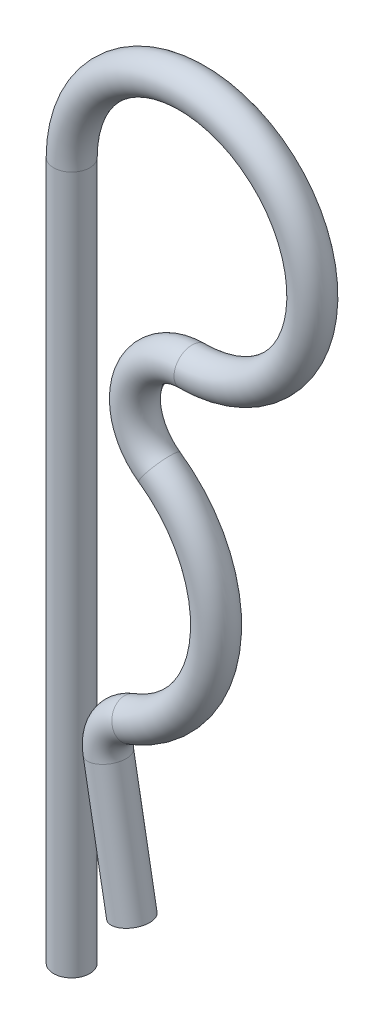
ISO-10303-21;
HEADER;
FILE_DESCRIPTION(('STEP AP214'),'2;1');
FILE_NAME('part.step','',(''),(''),'','','');
FILE_SCHEMA(('AUTOMOTIVE_DESIGN { 1 0 10303 214 1 1 1 1 }'));
ENDSEC;
DATA;
#1=APPLICATION_CONTEXT('core data for automotive mechanical design processes');
#2=APPLICATION_PROTOCOL_DEFINITION('international standard','automotive_design',2000,#1);
#3=PRODUCT_CONTEXT('',#1,'mechanical');
#4=PRODUCT('Part','Part','',(#3));
#5=PRODUCT_RELATED_PRODUCT_CATEGORY('part','',(#4));
#6=PRODUCT_DEFINITION_FORMATION('','',#4);
#7=PRODUCT_DEFINITION_CONTEXT('part definition',#1,'design');
#8=PRODUCT_DEFINITION('design','',#6,#7);
#9=PRODUCT_DEFINITION_SHAPE('','',#8);
#10=(LENGTH_UNIT() NAMED_UNIT(*) SI_UNIT(.MILLI.,.METRE.));
#11=(NAMED_UNIT(*) PLANE_ANGLE_UNIT() SI_UNIT($,.RADIAN.));
#12=(NAMED_UNIT(*) SI_UNIT($,.STERADIAN.) SOLID_ANGLE_UNIT());
#13=UNCERTAINTY_MEASURE_WITH_UNIT(LENGTH_MEASURE(1.E-05),#10,'distance_accuracy_value','');
#14=(GEOMETRIC_REPRESENTATION_CONTEXT(3) GLOBAL_UNCERTAINTY_ASSIGNED_CONTEXT((#13)) GLOBAL_UNIT_ASSIGNED_CONTEXT((#10,
#11,#12)) REPRESENTATION_CONTEXT('',''));
#15=CARTESIAN_POINT('',(0.,0.,0.));
#16=DIRECTION('',(0.,0.,1.));
#17=DIRECTION('',(1.,0.,0.));
#18=AXIS2_PLACEMENT_3D('',#15,#16,#17);
#19=CARTESIAN_POINT('',(3.04763114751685,16.7213987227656,0.));
#20=DIRECTION('',(0.177488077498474,-0.984122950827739,0.));
#21=DIRECTION('',(0.984122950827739,0.177488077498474,0.));
#22=AXIS2_PLACEMENT_3D('',#19,#20,#21);
#23=CYLINDRICAL_SURFACE('',#22,1.5);
#24=CARTESIAN_POINT('',(3.04763114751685,16.7213987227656,0.));
#25=DIRECTION('',(0.177488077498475,-0.984122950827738,0.));
#26=DIRECTION('',(0.,0.,1.));
#27=AXIS2_PLACEMENT_3D('',#24,#25,#26);
#28=CIRCLE('',#27,1.5);
#29=CARTESIAN_POINT('',(1.57144672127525,16.4551666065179,0.));
#30=VERTEX_POINT('',#29);
#31=EDGE_CURVE('E34',#30,#30,#28,.T.);
#32=ORIENTED_EDGE('',*,*,#31,.T.);
#33=EDGE_LOOP('',(#32));
#34=FACE_BOUND('',#33,.T.);
#35=CARTESIAN_POINT('',(5.00000000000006,5.89604626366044,0.));
#36=DIRECTION('',(0.177488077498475,-0.984122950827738,0.));
#37=DIRECTION('',(0.,0.,1.));
#38=AXIS2_PLACEMENT_3D('',#35,#36,#37);
#39=CIRCLE('',#38,1.5);
#40=CARTESIAN_POINT('',(5.00000000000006,5.89604626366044,1.5));
#41=VERTEX_POINT('',#40);
#42=EDGE_CURVE('E10',#41,#41,#39,.T.);
#43=ORIENTED_EDGE('',*,*,#42,.F.);
#44=EDGE_LOOP('',(#43));
#45=FACE_BOUND('',#44,.T.);
#46=ADVANCED_FACE('F28',(#34,#45),#23,.T.);
#47=CARTESIAN_POINT('',(6.,17.253862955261,0.));
#48=DIRECTION('',(0.,0.,1.));
#49=DIRECTION('',(1.,0.,0.));
#50=AXIS2_PLACEMENT_3D('',#47,#48,#49);
#51=TOROIDAL_SURFACE('',#50,2.99999999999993,1.5);
#52=CARTESIAN_POINT('',(4.92857142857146,20.0560122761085,0.));
#53=DIRECTION('',(-0.934049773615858,-0.357142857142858,0.));
#54=DIRECTION('',(0.,0.,1.));
#55=AXIS2_PLACEMENT_3D('',#52,#53,#54);
#56=CIRCLE('',#55,1.5);
#57=CARTESIAN_POINT('',(4.39285714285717,21.4570869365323,0.));
#58=VERTEX_POINT('',#57);
#59=EDGE_CURVE('E38',#58,#58,#56,.T.);
#60=CARTESIAN_POINT('',(6.,17.253862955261,0.));
#61=DIRECTION('',(0.,0.,1.));
#62=DIRECTION('',(1.,0.,0.));
#63=AXIS2_PLACEMENT_3D('',#60,#61,#62);
#64=CIRCLE('',#63,4.49999999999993);
#65=EDGE_CURVE('',#58,#30,#64,.T.);
#66=ORIENTED_EDGE('',*,*,#59,.T.);
#67=ORIENTED_EDGE('',*,*,#31,.F.);
#68=ORIENTED_EDGE('',*,*,#65,.T.);
#69=ORIENTED_EDGE('',*,*,#65,.F.);
#70=EDGE_LOOP('',(#66,#68,#67,#69));
#71=FACE_BOUND('',#70,.T.);
#72=ADVANCED_FACE('F68',(#71),#51,.T.);
#73=CARTESIAN_POINT('',(1.,30.330559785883,0.));
#74=DIRECTION('',(0.,0.,-1.));
#75=DIRECTION('',(-1.,0.,0.));
#76=AXIS2_PLACEMENT_3D('',#73,#74,#75);
#77=TOROIDAL_SURFACE('',#76,11.0000000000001,1.5);
#78=CARTESIAN_POINT('',(7.28676242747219,39.3569997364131,0.));
#79=DIRECTION('',(0.820585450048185,-0.571523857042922,0.));
#80=DIRECTION('',(0.,0.,1.));
#81=AXIS2_PLACEMENT_3D('',#78,#79,#80);
#82=CIRCLE('',#81,1.5);
#83=CARTESIAN_POINT('',(6.4294766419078,38.1261215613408,0.));
#84=VERTEX_POINT('',#83);
#85=EDGE_CURVE('E42',#84,#84,#82,.T.);
#86=ORIENTED_EDGE('',*,*,#85,.T.);
#87=EDGE_LOOP('',(#86));
#88=FACE_BOUND('',#87,.T.);
#89=ORIENTED_EDGE('',*,*,#59,.F.);
#90=EDGE_LOOP('',(#89));
#91=FACE_BOUND('',#90,.T.);
#92=ADVANCED_FACE('F72',(#88,#91),#77,.T.);
#93=CARTESIAN_POINT('',(10.,43.2526258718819,0.));
#94=DIRECTION('',(0.,0.,1.));
#95=DIRECTION('',(1.,0.,0.));
#96=AXIS2_PLACEMENT_3D('',#93,#94,#95);
#97=TOROIDAL_SURFACE('',#96,4.74737412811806,1.5);
#98=CARTESIAN_POINT('',(10.,48.,0.));
#99=DIRECTION('',(-1.,0.,0.));
#100=DIRECTION('',(0.,0.,1.));
#101=AXIS2_PLACEMENT_3D('',#98,#99,#100);
#102=CIRCLE('',#101,1.5);
#103=CARTESIAN_POINT('',(10.,49.5,0.));
#104=VERTEX_POINT('',#103);
#105=EDGE_CURVE('E47',#104,#104,#102,.T.);
#106=CARTESIAN_POINT('',(10.,43.2526258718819,0.));
#107=DIRECTION('',(0.,0.,1.));
#108=DIRECTION('',(1.,0.,0.));
#109=AXIS2_PLACEMENT_3D('',#106,#107,#108);
#110=CIRCLE('',#109,6.24737412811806);
#111=EDGE_CURVE('',#104,#84,#110,.T.);
#112=ORIENTED_EDGE('',*,*,#105,.T.);
#113=ORIENTED_EDGE('',*,*,#85,.F.);
#114=ORIENTED_EDGE('',*,*,#111,.T.);
#115=ORIENTED_EDGE('',*,*,#111,.F.);
#116=EDGE_LOOP('',(#112,#114,#113,#115));
#117=FACE_BOUND('',#116,.T.);
#118=ADVANCED_FACE('F78',(#117),#97,.T.);
#119=CARTESIAN_POINT('',(10.,58.,0.));
#120=DIRECTION('',(0.,0.,-1.));
#121=DIRECTION('',(-1.,0.,0.));
#122=AXIS2_PLACEMENT_3D('',#119,#120,#121);
#123=TOROIDAL_SURFACE('',#122,10.,1.5);
#124=CARTESIAN_POINT('',(0.,58.,0.));
#125=DIRECTION('',(0.,1.,0.));
#126=DIRECTION('',(0.,0.,1.));
#127=AXIS2_PLACEMENT_3D('',#124,#125,#126);
#128=CIRCLE('',#127,1.5);
#129=CARTESIAN_POINT('',(0.,58.,-1.5));
#130=VERTEX_POINT('',#129);
#131=EDGE_CURVE('E50',#130,#130,#128,.T.);
#132=ORIENTED_EDGE('',*,*,#131,.T.);
#133=EDGE_LOOP('',(#132));
#134=FACE_BOUND('',#133,.T.);
#135=ORIENTED_EDGE('',*,*,#105,.F.);
#136=EDGE_LOOP('',(#135));
#137=FACE_BOUND('',#136,.T.);
#138=ADVANCED_FACE('F85',(#134,#137),#123,.T.);
#139=CARTESIAN_POINT('',(0.,58.,0.));
#140=DIRECTION('',(0.,-1.,0.));
#141=DIRECTION('',(0.,0.,-1.));
#142=AXIS2_PLACEMENT_3D('',#139,#140,#141);
#143=CYLINDRICAL_SURFACE('',#142,1.5);
#144=CARTESIAN_POINT('',(0.,0.,0.));
#145=DIRECTION('',(0.,1.,0.));
#146=DIRECTION('',(0.,0.,1.));
#147=AXIS2_PLACEMENT_3D('',#144,#145,#146);
#148=CIRCLE('',#147,1.5);
#149=CARTESIAN_POINT('',(0.,0.,-1.5));
#150=VERTEX_POINT('',#149);
#151=EDGE_CURVE('E53',#150,#150,#148,.T.);
#152=CARTESIAN_POINT('',(0.,58.,-1.5));
#153=CARTESIAN_POINT('',(0.,57.3958333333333,-1.5));
#154=CARTESIAN_POINT('',(0.,56.7916666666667,-1.5));
#155=CARTESIAN_POINT('',(0.,55.5833333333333,-1.5));
#156=CARTESIAN_POINT('',(0.,54.9791666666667,-1.5));
#157=CARTESIAN_POINT('',(0.,53.7708333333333,-1.5));
#158=CARTESIAN_POINT('',(0.,53.1666666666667,-1.5));
#159=CARTESIAN_POINT('',(0.,51.9583333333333,-1.5));
#160=CARTESIAN_POINT('',(0.,51.3541666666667,-1.5));
#161=CARTESIAN_POINT('',(0.,50.1458333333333,-1.5));
#162=CARTESIAN_POINT('',(0.,49.5416666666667,-1.5));
#163=CARTESIAN_POINT('',(0.,48.3333333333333,-1.5));
#164=CARTESIAN_POINT('',(0.,47.7291666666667,-1.5));
#165=CARTESIAN_POINT('',(0.,46.5208333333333,-1.5));
#166=CARTESIAN_POINT('',(0.,45.9166666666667,-1.5));
#167=CARTESIAN_POINT('',(0.,44.7083333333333,-1.5));
#168=CARTESIAN_POINT('',(0.,44.1041666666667,-1.5));
#169=CARTESIAN_POINT('',(0.,42.8958333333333,-1.5));
#170=CARTESIAN_POINT('',(0.,42.2916666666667,-1.5));
#171=CARTESIAN_POINT('',(0.,41.0833333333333,-1.5));
#172=CARTESIAN_POINT('',(0.,40.4791666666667,-1.5));
#173=CARTESIAN_POINT('',(0.,39.2708333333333,-1.5));
#174=CARTESIAN_POINT('',(0.,38.6666666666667,-1.5));
#175=CARTESIAN_POINT('',(0.,37.4583333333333,-1.5));
#176=CARTESIAN_POINT('',(0.,36.8541666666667,-1.5));
#177=CARTESIAN_POINT('',(0.,35.6458333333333,-1.5));
#178=CARTESIAN_POINT('',(0.,35.0416666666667,-1.5));
#179=CARTESIAN_POINT('',(0.,33.8333333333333,-1.5));
#180=CARTESIAN_POINT('',(0.,33.2291666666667,-1.5));
#181=CARTESIAN_POINT('',(0.,32.0208333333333,-1.5));
#182=CARTESIAN_POINT('',(0.,31.4166666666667,-1.5));
#183=CARTESIAN_POINT('',(0.,30.2083333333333,-1.5));
#184=CARTESIAN_POINT('',(0.,29.6041666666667,-1.5));
#185=CARTESIAN_POINT('',(0.,28.3958333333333,-1.5));
#186=CARTESIAN_POINT('',(0.,27.7916666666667,-1.5));
#187=CARTESIAN_POINT('',(0.,26.5833333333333,-1.5));
#188=CARTESIAN_POINT('',(0.,25.9791666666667,-1.5));
#189=CARTESIAN_POINT('',(0.,24.7708333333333,-1.5));
#190=CARTESIAN_POINT('',(0.,24.1666666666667,-1.5));
#191=CARTESIAN_POINT('',(0.,22.9583333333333,-1.5));
#192=CARTESIAN_POINT('',(0.,22.3541666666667,-1.5));
#193=CARTESIAN_POINT('',(0.,21.1458333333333,-1.5));
#194=CARTESIAN_POINT('',(0.,20.5416666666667,-1.5));
#195=CARTESIAN_POINT('',(0.,19.3333333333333,-1.5));
#196=CARTESIAN_POINT('',(0.,18.7291666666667,-1.5));
#197=CARTESIAN_POINT('',(0.,17.5208333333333,-1.5));
#198=CARTESIAN_POINT('',(0.,16.9166666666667,-1.5));
#199=CARTESIAN_POINT('',(0.,15.7083333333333,-1.5));
#200=CARTESIAN_POINT('',(0.,15.1041666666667,-1.5));
#201=CARTESIAN_POINT('',(0.,13.8958333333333,-1.5));
#202=CARTESIAN_POINT('',(0.,13.2916666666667,-1.5));
#203=CARTESIAN_POINT('',(0.,12.0833333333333,-1.5));
#204=CARTESIAN_POINT('',(0.,11.4791666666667,-1.5));
#205=CARTESIAN_POINT('',(0.,10.2708333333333,-1.5));
#206=CARTESIAN_POINT('',(0.,9.66666666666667,-1.5));
#207=CARTESIAN_POINT('',(0.,8.45833333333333,-1.5));
#208=CARTESIAN_POINT('',(0.,7.85416666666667,-1.5));
#209=CARTESIAN_POINT('',(0.,6.64583333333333,-1.5));
#210=CARTESIAN_POINT('',(0.,6.04166666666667,-1.5));
#211=CARTESIAN_POINT('',(0.,4.83333333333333,-1.5));
#212=CARTESIAN_POINT('',(0.,4.22916666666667,-1.5));
#213=CARTESIAN_POINT('',(0.,3.02083333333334,-1.5));
#214=CARTESIAN_POINT('',(0.,2.41666666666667,-1.5));
#215=CARTESIAN_POINT('',(0.,1.20833333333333,-1.5));
#216=CARTESIAN_POINT('',(0.,0.604166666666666,-1.5));
#217=CARTESIAN_POINT('',(0.,0.,-1.5));
#218=B_SPLINE_CURVE_WITH_KNOTS('',3,(#152,#153,#154,#155,#156,#157,#158,#159,#160,#161,#162,
#163,#164,#165,#166,#167,#168,#169,#170,#171,#172,#173,#174,#175,#176,#177,#178,#179,#180,#181,
#182,#183,#184,#185,#186,#187,#188,#189,#190,#191,#192,#193,#194,#195,#196,#197,#198,#199,#200,
#201,#202,#203,#204,#205,#206,#207,#208,#209,#210,#211,#212,#213,#214,#215,#216,#217),
.UNSPECIFIED.,.F.,.F.,(4,2,2,2,2,2,2,2,2,2,2,2,2,2,2,2,2,2,2,2,2,2,2,2,2,2,2,2,2,2,2,2,4),(0.,
1.81249999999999,3.625,5.4375,7.24999999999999,9.06249999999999,10.875,12.6875,14.5,16.3125,
18.125,19.9375,21.75,23.5625,25.375,27.1875,29.,30.8125,32.625,34.4375,36.25,38.0625,39.875,
41.6875,43.5,45.3125,47.125,48.9375,50.75,52.5625,54.375,56.1875,58.),.UNSPECIFIED.);
#219=EDGE_CURVE('BSEAM57',#130,#150,#218,.T.);
#220=ORIENTED_EDGE('',*,*,#131,.F.);
#221=ORIENTED_EDGE('',*,*,#151,.T.);
#222=ORIENTED_EDGE('',*,*,#219,.T.);
#223=ORIENTED_EDGE('',*,*,#219,.F.);
#224=EDGE_LOOP('',(#220,#222,#221,#223));
#225=FACE_BOUND('',#224,.T.);
#226=ADVANCED_FACE('F57',(#225),#143,.T.);
#227=CARTESIAN_POINT('',(5.00000000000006,5.89604626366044,0.));
#228=DIRECTION('',(0.177488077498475,-0.984122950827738,0.));
#229=DIRECTION('',(0.,0.,1.));
#230=AXIS2_PLACEMENT_3D('',#227,#228,#229);
#231=PLANE('',#230);
#232=ORIENTED_EDGE('',*,*,#42,.T.);
#233=EDGE_LOOP('',(#232));
#234=FACE_BOUND('',#233,.T.);
#235=ADVANCED_FACE('F61',(#234),#231,.T.);
#236=CARTESIAN_POINT('',(0.,0.,0.));
#237=DIRECTION('',(0.,1.,0.));
#238=DIRECTION('',(0.,0.,1.));
#239=AXIS2_PLACEMENT_3D('',#236,#237,#238);
#240=PLANE('',#239);
#241=ORIENTED_EDGE('',*,*,#151,.F.);
#242=EDGE_LOOP('',(#241));
#243=FACE_BOUND('',#242,.T.);
#244=ADVANCED_FACE('F59',(#243),#240,.F.);
#245=CLOSED_SHELL('',(#46,#72,#92,#118,#138,#226,#235,#244));
#246=MANIFOLD_SOLID_BREP('B2',#245);
#247=ADVANCED_BREP_SHAPE_REPRESENTATION('',(#18,#246),#14);
#248=SHAPE_DEFINITION_REPRESENTATION(#9,#247);
ENDSEC;
END-ISO-10303-21;
